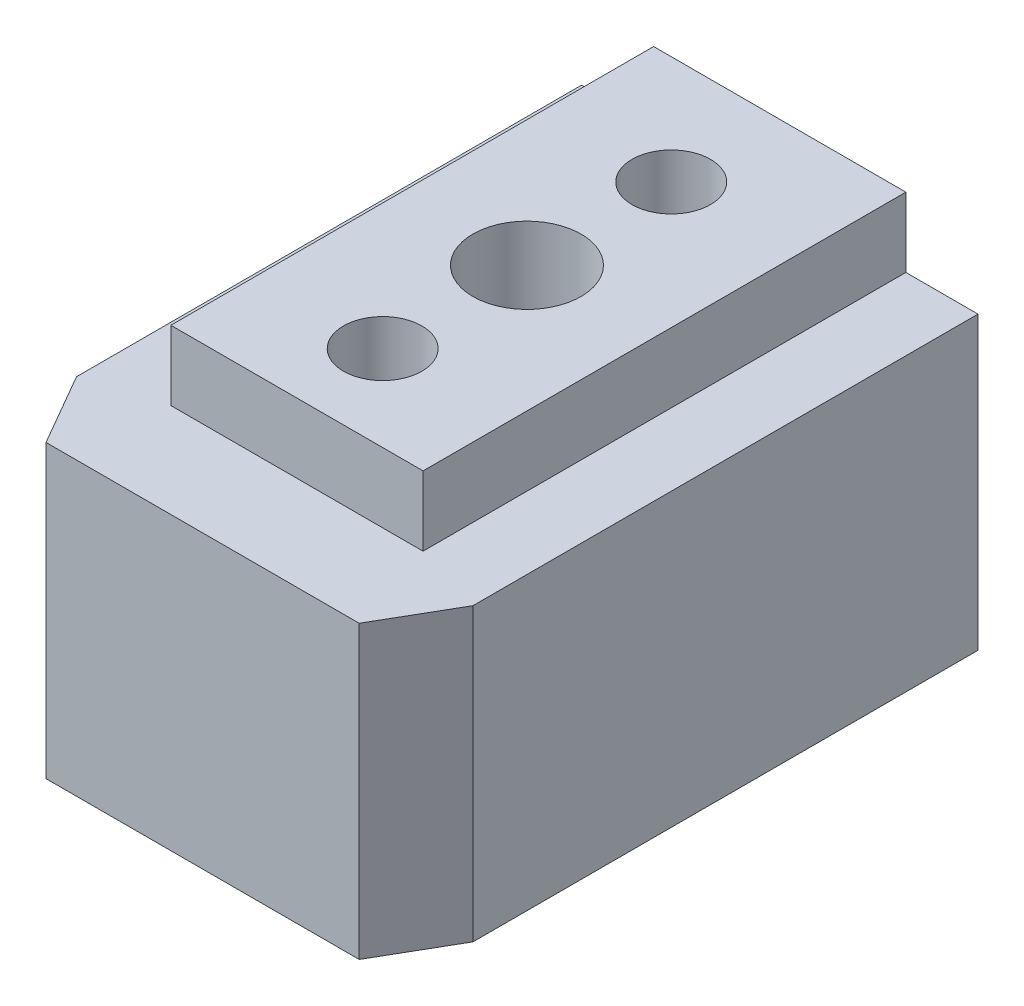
ISO-10303-21;
HEADER;
FILE_DESCRIPTION(('STEP AP214'),'2;1');
FILE_NAME('part.step','',(''),(''),'','','');
FILE_SCHEMA(('AUTOMOTIVE_DESIGN { 1 0 10303 214 1 1 1 1 }'));
ENDSEC;
DATA;
#1=APPLICATION_CONTEXT('core data for automotive mechanical design processes');
#2=APPLICATION_PROTOCOL_DEFINITION('international standard','automotive_design',2000,#1);
#3=PRODUCT_CONTEXT('',#1,'mechanical');
#4=PRODUCT('Part','Part','',(#3));
#5=PRODUCT_RELATED_PRODUCT_CATEGORY('part','',(#4));
#6=PRODUCT_DEFINITION_FORMATION('','',#4);
#7=PRODUCT_DEFINITION_CONTEXT('part definition',#1,'design');
#8=PRODUCT_DEFINITION('design','',#6,#7);
#9=PRODUCT_DEFINITION_SHAPE('','',#8);
#10=(LENGTH_UNIT() NAMED_UNIT(*) SI_UNIT(.MILLI.,.METRE.));
#11=(NAMED_UNIT(*) PLANE_ANGLE_UNIT() SI_UNIT($,.RADIAN.));
#12=(NAMED_UNIT(*) SI_UNIT($,.STERADIAN.) SOLID_ANGLE_UNIT());
#13=UNCERTAINTY_MEASURE_WITH_UNIT(LENGTH_MEASURE(1.E-05),#10,'distance_accuracy_value','');
#14=(GEOMETRIC_REPRESENTATION_CONTEXT(3) GLOBAL_UNCERTAINTY_ASSIGNED_CONTEXT((#13)) GLOBAL_UNIT_ASSIGNED_CONTEXT((#10,
#11,#12)) REPRESENTATION_CONTEXT('',''));
#15=CARTESIAN_POINT('',(0.,0.,0.));
#16=DIRECTION('',(0.,0.,1.));
#17=DIRECTION('',(1.,0.,0.));
#18=AXIS2_PLACEMENT_3D('',#15,#16,#17);
#19=CARTESIAN_POINT('',(-8.7249,6.40715,-12.7));
#20=DIRECTION('',(1.,0.,0.));
#21=DIRECTION('',(0.,0.,-1.));
#22=AXIS2_PLACEMENT_3D('',#19,#20,#21);
#23=PLANE('',#22);
#24=DIRECTION('',(0.,0.,1.));
#25=VECTOR('',#24,1.);
#26=CARTESIAN_POINT('',(-8.7249,-6.40715,-12.7));
#27=LINE('',#26,#25);
#28=CARTESIAN_POINT('',(-8.7249,-6.40715,-12.7));
#29=VERTEX_POINT('',#28);
#30=CARTESIAN_POINT('',(-8.7249,-6.40715,9.52499999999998));
#31=VERTEX_POINT('',#30);
#32=EDGE_CURVE('E216',#29,#31,#27,.T.);
#33=ORIENTED_EDGE('',*,*,#32,.T.);
#34=DIRECTION('',(0.,1.,0.));
#35=VECTOR('',#34,1.);
#36=CARTESIAN_POINT('',(-8.7249,6.40715,9.52499999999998));
#37=LINE('',#36,#35);
#38=CARTESIAN_POINT('',(-8.7249,6.40715,9.52499999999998));
#39=VERTEX_POINT('',#38);
#40=EDGE_CURVE('E44',#31,#39,#37,.T.);
#41=ORIENTED_EDGE('',*,*,#40,.T.);
#42=DIRECTION('',(0.,0.,1.));
#43=VECTOR('',#42,1.);
#44=CARTESIAN_POINT('',(-8.7249,6.40715,-12.7));
#45=LINE('',#44,#43);
#46=CARTESIAN_POINT('',(-8.7249,6.40715,-12.7));
#47=VERTEX_POINT('',#46);
#48=EDGE_CURVE('E225',#47,#39,#45,.T.);
#49=ORIENTED_EDGE('',*,*,#48,.F.);
#50=DIRECTION('',(0.,-1.,0.));
#51=VECTOR('',#50,1.);
#52=CARTESIAN_POINT('',(-8.7249,6.40715,-12.7));
#53=LINE('',#52,#51);
#54=EDGE_CURVE('E226',#47,#29,#53,.T.);
#55=ORIENTED_EDGE('',*,*,#54,.T.);
#56=EDGE_LOOP('',(#33,#41,#49,#55));
#57=FACE_BOUND('',#56,.T.);
#58=ADVANCED_FACE('F36',(#57),#23,.F.);
#59=CARTESIAN_POINT('',(-8.7249,6.40715,12.7));
#60=DIRECTION('',(0.,0.,-1.));
#61=DIRECTION('',(-1.,0.,0.));
#62=AXIS2_PLACEMENT_3D('',#59,#60,#61);
#63=PLANE('',#62);
#64=DIRECTION('',(1.,0.,0.));
#65=VECTOR('',#64,1.);
#66=CARTESIAN_POINT('',(-8.7249,6.40715,12.7));
#67=LINE('',#66,#65);
#68=CARTESIAN_POINT('',(-6.89181289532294,6.40715,12.7));
#69=VERTEX_POINT('',#68);
#70=CARTESIAN_POINT('',(6.89181289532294,6.40715,12.7));
#71=VERTEX_POINT('',#70);
#72=EDGE_CURVE('E209',#69,#71,#67,.T.);
#73=ORIENTED_EDGE('',*,*,#72,.F.);
#74=DIRECTION('',(0.,-1.,0.));
#75=VECTOR('',#74,1.);
#76=CARTESIAN_POINT('',(-6.89181289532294,6.40715,12.7));
#77=LINE('',#76,#75);
#78=CARTESIAN_POINT('',(-6.89181289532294,-6.40715,12.7));
#79=VERTEX_POINT('',#78);
#80=EDGE_CURVE('E201',#69,#79,#77,.T.);
#81=ORIENTED_EDGE('',*,*,#80,.T.);
#82=DIRECTION('',(1.,0.,0.));
#83=VECTOR('',#82,1.);
#84=CARTESIAN_POINT('',(-8.7249,-6.40715,12.7));
#85=LINE('',#84,#83);
#86=CARTESIAN_POINT('',(6.89181289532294,-6.40715,12.7));
#87=VERTEX_POINT('',#86);
#88=EDGE_CURVE('E208',#79,#87,#85,.T.);
#89=ORIENTED_EDGE('',*,*,#88,.T.);
#90=DIRECTION('',(0.,1.,0.));
#91=VECTOR('',#90,1.);
#92=CARTESIAN_POINT('',(6.89181289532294,6.40715,12.7));
#93=LINE('',#92,#91);
#94=EDGE_CURVE('E196',#87,#71,#93,.T.);
#95=ORIENTED_EDGE('',*,*,#94,.T.);
#96=EDGE_LOOP('',(#73,#81,#89,#95));
#97=FACE_BOUND('',#96,.T.);
#98=ADVANCED_FACE('F207',(#97),#63,.F.);
#99=CARTESIAN_POINT('',(8.7249,6.40715,-12.7));
#100=DIRECTION('',(-1.,0.,0.));
#101=DIRECTION('',(0.,0.,1.));
#102=AXIS2_PLACEMENT_3D('',#99,#100,#101);
#103=PLANE('',#102);
#104=DIRECTION('',(0.,0.,-1.));
#105=VECTOR('',#104,1.);
#106=CARTESIAN_POINT('',(8.7249,6.40715,-12.7));
#107=LINE('',#106,#105);
#108=CARTESIAN_POINT('',(8.7249,6.40715,9.52499999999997));
#109=VERTEX_POINT('',#108);
#110=CARTESIAN_POINT('',(8.7249,6.40715,-12.7));
#111=VERTEX_POINT('',#110);
#112=EDGE_CURVE('E237',#109,#111,#107,.T.);
#113=ORIENTED_EDGE('',*,*,#112,.F.);
#114=DIRECTION('',(0.,-1.,0.));
#115=VECTOR('',#114,1.);
#116=CARTESIAN_POINT('',(8.7249,6.40715,9.52499999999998));
#117=LINE('',#116,#115);
#118=CARTESIAN_POINT('',(8.7249,-6.40715,9.52499999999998));
#119=VERTEX_POINT('',#118);
#120=EDGE_CURVE('E189',#109,#119,#117,.T.);
#121=ORIENTED_EDGE('',*,*,#120,.T.);
#122=DIRECTION('',(0.,0.,-1.));
#123=VECTOR('',#122,1.);
#124=CARTESIAN_POINT('',(8.7249,-6.40715,-12.7));
#125=LINE('',#124,#123);
#126=CARTESIAN_POINT('',(8.7249,-6.40715,-12.7));
#127=VERTEX_POINT('',#126);
#128=EDGE_CURVE('E215',#119,#127,#125,.T.);
#129=ORIENTED_EDGE('',*,*,#128,.T.);
#130=DIRECTION('',(0.,-1.,0.));
#131=VECTOR('',#130,1.);
#132=CARTESIAN_POINT('',(8.7249,6.40715,-12.7));
#133=LINE('',#132,#131);
#134=EDGE_CURVE('E193',#111,#127,#133,.T.);
#135=ORIENTED_EDGE('',*,*,#134,.F.);
#136=EDGE_LOOP('',(#113,#121,#129,#135));
#137=FACE_BOUND('',#136,.T.);
#138=ADVANCED_FACE('F288',(#137),#103,.F.);
#139=CARTESIAN_POINT('',(-8.7249,6.40715,-12.7));
#140=DIRECTION('',(0.,0.,1.));
#141=DIRECTION('',(1.,0.,0.));
#142=AXIS2_PLACEMENT_3D('',#139,#140,#141);
#143=PLANE('',#142);
#144=CARTESIAN_POINT('',(-5.55498,-3.23215,-12.7));
#145=DIRECTION('',(0.,0.,-1.));
#146=DIRECTION('',(-1.,0.,0.));
#147=AXIS2_PLACEMENT_3D('',#144,#145,#146);
#148=CIRCLE('',#147,1.5875);
#149=CARTESIAN_POINT('',(-7.14248,-3.23215,-12.7));
#150=VERTEX_POINT('',#149);
#151=EDGE_CURVE('E526',#150,#150,#148,.T.);
#152=ORIENTED_EDGE('',*,*,#151,.F.);
#153=EDGE_LOOP('',(#152));
#154=FACE_BOUND('',#153,.T.);
#155=CARTESIAN_POINT('',(5.55498,-3.23215,-12.7));
#156=DIRECTION('',(0.,0.,-1.));
#157=DIRECTION('',(-1.,0.,0.));
#158=AXIS2_PLACEMENT_3D('',#155,#156,#157);
#159=CIRCLE('',#158,1.5875);
#160=CARTESIAN_POINT('',(3.96748,-3.23215,-12.7));
#161=VERTEX_POINT('',#160);
#162=EDGE_CURVE('E140',#161,#161,#159,.T.);
#163=ORIENTED_EDGE('',*,*,#162,.F.);
#164=EDGE_LOOP('',(#163));
#165=FACE_BOUND('',#164,.T.);
#166=CARTESIAN_POINT('',(5.55498,3.11785,-12.7));
#167=DIRECTION('',(0.,0.,-1.));
#168=DIRECTION('',(-1.,0.,0.));
#169=AXIS2_PLACEMENT_3D('',#166,#167,#168);
#170=CIRCLE('',#169,1.72719999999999);
#171=CARTESIAN_POINT('',(3.82778000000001,3.11785,-12.7));
#172=VERTEX_POINT('',#171);
#173=EDGE_CURVE('E133',#172,#172,#170,.T.);
#174=ORIENTED_EDGE('',*,*,#173,.F.);
#175=EDGE_LOOP('',(#174));
#176=FACE_BOUND('',#175,.T.);
#177=CARTESIAN_POINT('',(-5.55498,3.11785,-12.7));
#178=DIRECTION('',(0.,0.,-1.));
#179=DIRECTION('',(-1.,0.,0.));
#180=AXIS2_PLACEMENT_3D('',#177,#178,#179);
#181=CIRCLE('',#180,1.72719999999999);
#182=CARTESIAN_POINT('',(-7.28217999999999,3.11785,-12.7));
#183=VERTEX_POINT('',#182);
#184=EDGE_CURVE('E146',#183,#183,#181,.T.);
#185=ORIENTED_EDGE('',*,*,#184,.F.);
#186=EDGE_LOOP('',(#185));
#187=FACE_BOUND('',#186,.T.);
#188=DIRECTION('',(-1.,0.,0.));
#189=VECTOR('',#188,1.);
#190=CARTESIAN_POINT('',(-8.7249,-6.40715,-12.7));
#191=LINE('',#190,#189);
#192=EDGE_CURVE('E218',#127,#29,#191,.T.);
#193=ORIENTED_EDGE('',*,*,#192,.T.);
#194=ORIENTED_EDGE('',*,*,#54,.F.);
#195=DIRECTION('',(-1.,0.,0.));
#196=VECTOR('',#195,1.);
#197=CARTESIAN_POINT('',(-8.7249,6.40715,-12.7));
#198=LINE('',#197,#196);
#199=CARTESIAN_POINT('',(-5.5499,6.40715,-12.7));
#200=VERTEX_POINT('',#199);
#201=EDGE_CURVE('E233',#200,#47,#198,.T.);
#202=ORIENTED_EDGE('',*,*,#201,.F.);
#203=DIRECTION('',(0.,-1.,0.));
#204=VECTOR('',#203,1.);
#205=CARTESIAN_POINT('',(-5.5499,9.46785,-12.7));
#206=LINE('',#205,#204);
#207=CARTESIAN_POINT('',(-5.5499,9.46785,-12.7));
#208=VERTEX_POINT('',#207);
#209=EDGE_CURVE('E244',#208,#200,#206,.T.);
#210=ORIENTED_EDGE('',*,*,#209,.F.);
#211=DIRECTION('',(-1.,0.,0.));
#212=VECTOR('',#211,1.);
#213=CARTESIAN_POINT('',(5.5499,9.46785,-12.7));
#214=LINE('',#213,#212);
#215=CARTESIAN_POINT('',(5.5499,9.46785,-12.7));
#216=VERTEX_POINT('',#215);
#217=EDGE_CURVE('E171',#216,#208,#214,.T.);
#218=ORIENTED_EDGE('',*,*,#217,.F.);
#219=DIRECTION('',(0.,-1.,0.));
#220=VECTOR('',#219,1.);
#221=CARTESIAN_POINT('',(5.5499,9.46785,-12.7));
#222=LINE('',#221,#220);
#223=CARTESIAN_POINT('',(5.5499,6.40715,-12.7));
#224=VERTEX_POINT('',#223);
#225=EDGE_CURVE('E220',#216,#224,#222,.T.);
#226=ORIENTED_EDGE('',*,*,#225,.T.);
#227=EDGE_CURVE('E229',#111,#224,#198,.T.);
#228=ORIENTED_EDGE('',*,*,#227,.F.);
#229=ORIENTED_EDGE('',*,*,#134,.T.);
#230=EDGE_LOOP('',(#193,#194,#202,#210,#218,#226,#228,#229));
#231=FACE_BOUND('',#230,.T.);
#232=ADVANCED_FACE('F268',(#154,#165,#176,#187,#231),#143,.F.);
#233=CARTESIAN_POINT('',(-8.7249,6.40715,12.7));
#234=DIRECTION('',(0.,1.,0.));
#235=DIRECTION('',(0.,0.,1.));
#236=AXIS2_PLACEMENT_3D('',#233,#234,#235);
#237=PLANE('',#236);
#238=ORIENTED_EDGE('',*,*,#48,.T.);
#239=DIRECTION('',(-0.499999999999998,0.,-0.86602540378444));
#240=VECTOR('',#239,1.);
#241=CARTESIAN_POINT('',(-7.3500846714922,6.40715,11.90625));
#242=LINE('',#241,#240);
#243=EDGE_CURVE('E11',#39,#69,#242,.F.);
#244=ORIENTED_EDGE('',*,*,#243,.T.);
#245=ORIENTED_EDGE('',*,*,#72,.T.);
#246=DIRECTION('',(-0.499999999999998,0.,0.86602540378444));
#247=VECTOR('',#246,1.);
#248=CARTESIAN_POINT('',(2.98763467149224,6.40715,19.4622350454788));
#249=LINE('',#248,#247);
#250=EDGE_CURVE('E199',#71,#109,#249,.F.);
#251=ORIENTED_EDGE('',*,*,#250,.T.);
#252=ORIENTED_EDGE('',*,*,#112,.T.);
#253=ORIENTED_EDGE('',*,*,#227,.T.);
#254=DIRECTION('',(0.,0.,-1.));
#255=VECTOR('',#254,1.);
#256=CARTESIAN_POINT('',(5.5499,6.40715,-12.7));
#257=LINE('',#256,#255);
#258=CARTESIAN_POINT('',(5.5499,6.40715,8.5471));
#259=VERTEX_POINT('',#258);
#260=EDGE_CURVE('E167',#259,#224,#257,.T.);
#261=ORIENTED_EDGE('',*,*,#260,.F.);
#262=DIRECTION('',(1.,0.,0.));
#263=VECTOR('',#262,1.);
#264=CARTESIAN_POINT('',(5.5499,6.40715,8.5471));
#265=LINE('',#264,#263);
#266=CARTESIAN_POINT('',(-5.5499,6.40715,8.5471));
#267=VERTEX_POINT('',#266);
#268=EDGE_CURVE('E172',#267,#259,#265,.T.);
#269=ORIENTED_EDGE('',*,*,#268,.F.);
#270=DIRECTION('',(0.,0.,1.));
#271=VECTOR('',#270,1.);
#272=CARTESIAN_POINT('',(-5.5499,6.40715,-12.7));
#273=LINE('',#272,#271);
#274=EDGE_CURVE('E186',#200,#267,#273,.T.);
#275=ORIENTED_EDGE('',*,*,#274,.F.);
#276=ORIENTED_EDGE('',*,*,#201,.T.);
#277=EDGE_LOOP('',(#238,#244,#245,#251,#252,#253,#261,#269,#275,#276));
#278=FACE_BOUND('',#277,.T.);
#279=ADVANCED_FACE('F304',(#278),#237,.T.);
#280=CARTESIAN_POINT('',(-8.7249,-6.40715,12.7));
#281=DIRECTION('',(0.,1.,0.));
#282=DIRECTION('',(0.,0.,1.));
#283=AXIS2_PLACEMENT_3D('',#280,#281,#282);
#284=PLANE('',#283);
#285=ORIENTED_EDGE('',*,*,#88,.F.);
#286=DIRECTION('',(0.499999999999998,0.,0.86602540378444));
#287=VECTOR('',#286,1.);
#288=CARTESIAN_POINT('',(-6.89181289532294,-6.40715,12.7));
#289=LINE('',#288,#287);
#290=EDGE_CURVE('E58',#79,#31,#289,.F.);
#291=ORIENTED_EDGE('',*,*,#290,.T.);
#292=ORIENTED_EDGE('',*,*,#32,.F.);
#293=ORIENTED_EDGE('',*,*,#192,.F.);
#294=ORIENTED_EDGE('',*,*,#128,.F.);
#295=DIRECTION('',(0.499999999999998,0.,-0.86602540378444));
#296=VECTOR('',#295,1.);
#297=CARTESIAN_POINT('',(8.7249,-6.40715,9.52499999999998));
#298=LINE('',#297,#296);
#299=EDGE_CURVE('E192',#119,#87,#298,.F.);
#300=ORIENTED_EDGE('',*,*,#299,.T.);
#301=EDGE_LOOP('',(#285,#291,#292,#293,#294,#300));
#302=FACE_BOUND('',#301,.T.);
#303=ADVANCED_FACE('F212',(#302),#284,.F.);
#304=CARTESIAN_POINT('',(5.5499,9.46785,-12.7));
#305=DIRECTION('',(-1.,0.,0.));
#306=DIRECTION('',(0.,0.,1.));
#307=AXIS2_PLACEMENT_3D('',#304,#305,#306);
#308=PLANE('',#307);
#309=ORIENTED_EDGE('',*,*,#260,.T.);
#310=ORIENTED_EDGE('',*,*,#225,.F.);
#311=DIRECTION('',(0.,0.,-1.));
#312=VECTOR('',#311,1.);
#313=CARTESIAN_POINT('',(5.5499,9.46785,-12.7));
#314=LINE('',#313,#312);
#315=CARTESIAN_POINT('',(5.5499,9.46785,8.5471));
#316=VERTEX_POINT('',#315);
#317=EDGE_CURVE('E168',#316,#216,#314,.T.);
#318=ORIENTED_EDGE('',*,*,#317,.F.);
#319=DIRECTION('',(0.,-1.,0.));
#320=VECTOR('',#319,1.);
#321=CARTESIAN_POINT('',(5.5499,9.46785,8.5471));
#322=LINE('',#321,#320);
#323=EDGE_CURVE('E178',#316,#259,#322,.T.);
#324=ORIENTED_EDGE('',*,*,#323,.T.);
#325=EDGE_LOOP('',(#309,#310,#318,#324));
#326=FACE_BOUND('',#325,.T.);
#327=ADVANCED_FACE('F249',(#326),#308,.F.);
#328=CARTESIAN_POINT('',(-5.5499,9.46785,-12.7));
#329=DIRECTION('',(1.,0.,0.));
#330=DIRECTION('',(0.,0.,-1.));
#331=AXIS2_PLACEMENT_3D('',#328,#329,#330);
#332=PLANE('',#331);
#333=ORIENTED_EDGE('',*,*,#274,.T.);
#334=DIRECTION('',(0.,-1.,0.));
#335=VECTOR('',#334,1.);
#336=CARTESIAN_POINT('',(-5.5499,9.46785,8.5471));
#337=LINE('',#336,#335);
#338=CARTESIAN_POINT('',(-5.5499,9.46785,8.5471));
#339=VERTEX_POINT('',#338);
#340=EDGE_CURVE('E242',#339,#267,#337,.T.);
#341=ORIENTED_EDGE('',*,*,#340,.F.);
#342=DIRECTION('',(0.,0.,1.));
#343=VECTOR('',#342,1.);
#344=CARTESIAN_POINT('',(-5.5499,9.46785,-12.7));
#345=LINE('',#344,#343);
#346=EDGE_CURVE('E174',#208,#339,#345,.T.);
#347=ORIENTED_EDGE('',*,*,#346,.F.);
#348=ORIENTED_EDGE('',*,*,#209,.T.);
#349=EDGE_LOOP('',(#333,#341,#347,#348));
#350=FACE_BOUND('',#349,.T.);
#351=ADVANCED_FACE('F274',(#350),#332,.F.);
#352=CARTESIAN_POINT('',(5.5499,9.46785,8.5471));
#353=DIRECTION('',(0.,0.,-1.));
#354=DIRECTION('',(-1.,0.,0.));
#355=AXIS2_PLACEMENT_3D('',#352,#353,#354);
#356=PLANE('',#355);
#357=ORIENTED_EDGE('',*,*,#268,.T.);
#358=ORIENTED_EDGE('',*,*,#323,.F.);
#359=DIRECTION('',(1.,0.,0.));
#360=VECTOR('',#359,1.);
#361=CARTESIAN_POINT('',(5.5499,9.46785,8.5471));
#362=LINE('',#361,#360);
#363=EDGE_CURVE('E176',#339,#316,#362,.T.);
#364=ORIENTED_EDGE('',*,*,#363,.F.);
#365=ORIENTED_EDGE('',*,*,#340,.T.);
#366=EDGE_LOOP('',(#357,#358,#364,#365));
#367=FACE_BOUND('',#366,.T.);
#368=ADVANCED_FACE('F254',(#367),#356,.F.);
#369=CARTESIAN_POINT('',(5.5499,9.46785,8.5471));
#370=DIRECTION('',(0.,-1.,0.));
#371=DIRECTION('',(0.,0.,-1.));
#372=AXIS2_PLACEMENT_3D('',#369,#370,#371);
#373=PLANE('',#372);
#374=CARTESIAN_POINT('',(0.,9.46785,-1.5748));
#375=DIRECTION('',(0.,1.,0.));
#376=DIRECTION('',(0.,0.,1.));
#377=AXIS2_PLACEMENT_3D('',#374,#375,#376);
#378=CIRCLE('',#377,2.38125);
#379=CARTESIAN_POINT('',(0.,9.46785,0.806450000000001));
#380=VERTEX_POINT('',#379);
#381=EDGE_CURVE('E149',#380,#380,#378,.T.);
#382=ORIENTED_EDGE('',*,*,#381,.F.);
#383=EDGE_LOOP('',(#382));
#384=FACE_BOUND('',#383,.T.);
#385=CARTESIAN_POINT('',(0.,9.46785,4.7752));
#386=DIRECTION('',(0.,1.,0.));
#387=DIRECTION('',(0.,0.,1.));
#388=AXIS2_PLACEMENT_3D('',#385,#386,#387);
#389=CIRCLE('',#388,1.7272);
#390=CARTESIAN_POINT('',(0.,9.46785,6.5024));
#391=VERTEX_POINT('',#390);
#392=EDGE_CURVE('E158',#391,#391,#389,.T.);
#393=ORIENTED_EDGE('',*,*,#392,.F.);
#394=EDGE_LOOP('',(#393));
#395=FACE_BOUND('',#394,.T.);
#396=CARTESIAN_POINT('',(0.,9.46785,-7.9248));
#397=DIRECTION('',(0.,1.,0.));
#398=DIRECTION('',(0.,0.,1.));
#399=AXIS2_PLACEMENT_3D('',#396,#397,#398);
#400=CIRCLE('',#399,1.7272);
#401=CARTESIAN_POINT('',(0.,9.46785,-6.1976));
#402=VERTEX_POINT('',#401);
#403=EDGE_CURVE('E164',#402,#402,#400,.T.);
#404=ORIENTED_EDGE('',*,*,#403,.F.);
#405=EDGE_LOOP('',(#404));
#406=FACE_BOUND('',#405,.T.);
#407=ORIENTED_EDGE('',*,*,#317,.T.);
#408=ORIENTED_EDGE('',*,*,#217,.T.);
#409=ORIENTED_EDGE('',*,*,#346,.T.);
#410=ORIENTED_EDGE('',*,*,#363,.T.);
#411=EDGE_LOOP('',(#407,#408,#409,#410));
#412=FACE_BOUND('',#411,.T.);
#413=ADVANCED_FACE('F273',(#384,#395,#406,#412),#373,.F.);
#414=CARTESIAN_POINT('',(8.7249,6.40715,9.52499999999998));
#415=DIRECTION('',(-0.86602540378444,0.,-0.499999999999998));
#416=DIRECTION('',(-0.499999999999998,0.,0.86602540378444));
#417=AXIS2_PLACEMENT_3D('',#414,#415,#416);
#418=PLANE('',#417);
#419=ORIENTED_EDGE('',*,*,#250,.F.);
#420=ORIENTED_EDGE('',*,*,#94,.F.);
#421=ORIENTED_EDGE('',*,*,#299,.F.);
#422=ORIENTED_EDGE('',*,*,#120,.F.);
#423=EDGE_LOOP('',(#419,#420,#421,#422));
#424=FACE_BOUND('',#423,.T.);
#425=ADVANCED_FACE('F291',(#424),#418,.F.);
#426=CARTESIAN_POINT('',(-6.89181289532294,6.40715,12.7));
#427=DIRECTION('',(0.86602540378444,0.,-0.499999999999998));
#428=DIRECTION('',(-0.499999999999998,0.,-0.86602540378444));
#429=AXIS2_PLACEMENT_3D('',#426,#427,#428);
#430=PLANE('',#429);
#431=ORIENTED_EDGE('',*,*,#243,.F.);
#432=ORIENTED_EDGE('',*,*,#40,.F.);
#433=ORIENTED_EDGE('',*,*,#290,.F.);
#434=ORIENTED_EDGE('',*,*,#80,.F.);
#435=EDGE_LOOP('',(#431,#432,#433,#434));
#436=FACE_BOUND('',#435,.T.);
#437=ADVANCED_FACE('F38',(#436),#430,.F.);
#438=CARTESIAN_POINT('',(0.,9.46785,-7.9248));
#439=DIRECTION('',(0.,1.,0.));
#440=DIRECTION('',(0.,0.,1.));
#441=AXIS2_PLACEMENT_3D('',#438,#439,#440);
#442=CYLINDRICAL_SURFACE('',#441,1.7272);
#443=CARTESIAN_POINT('',(0.,-2.82575,-7.9248));
#444=DIRECTION('',(0.,1.,0.));
#445=DIRECTION('',(0.,0.,1.));
#446=AXIS2_PLACEMENT_3D('',#443,#444,#445);
#447=CIRCLE('',#446,1.7272);
#448=CARTESIAN_POINT('',(0.,-2.82575,-6.1976));
#449=VERTEX_POINT('',#448);
#450=EDGE_CURVE('E161',#449,#449,#447,.T.);
#451=ORIENTED_EDGE('',*,*,#450,.F.);
#452=EDGE_LOOP('',(#451));
#453=FACE_BOUND('',#452,.T.);
#454=ORIENTED_EDGE('',*,*,#403,.T.);
#455=EDGE_LOOP('',(#454));
#456=FACE_BOUND('',#455,.T.);
#457=ADVANCED_FACE('F298',(#453,#456),#442,.F.);
#458=CARTESIAN_POINT('',(0.,-2.82575,-7.9248));
#459=DIRECTION('',(0.,1.,0.));
#460=DIRECTION('',(0.,0.,1.));
#461=AXIS2_PLACEMENT_3D('',#458,#459,#460);
#462=CONICAL_SURFACE('',#461,1.7272,1.02974425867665);
#463=CARTESIAN_POINT('',(0.,-3.8635564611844,-7.9248));
#464=VERTEX_POINT('',#463);
#465=VERTEX_LOOP('',#464);
#466=FACE_BOUND('',#465,.T.);
#467=ORIENTED_EDGE('',*,*,#450,.T.);
#468=EDGE_LOOP('',(#467));
#469=FACE_BOUND('',#468,.T.);
#470=ADVANCED_FACE('F380',(#466,#469),#462,.F.);
#471=CARTESIAN_POINT('',(0.,9.46785,4.7752));
#472=DIRECTION('',(0.,1.,0.));
#473=DIRECTION('',(0.,0.,1.));
#474=AXIS2_PLACEMENT_3D('',#471,#472,#473);
#475=CYLINDRICAL_SURFACE('',#474,1.7272);
#476=CARTESIAN_POINT('',(0.,-2.82575,4.7752));
#477=DIRECTION('',(0.,1.,0.));
#478=DIRECTION('',(0.,0.,1.));
#479=AXIS2_PLACEMENT_3D('',#476,#477,#478);
#480=CIRCLE('',#479,1.7272);
#481=CARTESIAN_POINT('',(0.,-2.82575,6.5024));
#482=VERTEX_POINT('',#481);
#483=EDGE_CURVE('E153',#482,#482,#480,.T.);
#484=ORIENTED_EDGE('',*,*,#483,.F.);
#485=EDGE_LOOP('',(#484));
#486=FACE_BOUND('',#485,.T.);
#487=ORIENTED_EDGE('',*,*,#392,.T.);
#488=EDGE_LOOP('',(#487));
#489=FACE_BOUND('',#488,.T.);
#490=ADVANCED_FACE('F390',(#486,#489),#475,.F.);
#491=CARTESIAN_POINT('',(0.,-2.82575,4.7752));
#492=DIRECTION('',(0.,1.,0.));
#493=DIRECTION('',(0.,0.,1.));
#494=AXIS2_PLACEMENT_3D('',#491,#492,#493);
#495=CONICAL_SURFACE('',#494,1.7272,1.02974425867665);
#496=CARTESIAN_POINT('',(0.,-3.8635564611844,4.7752));
#497=VERTEX_POINT('',#496);
#498=VERTEX_LOOP('',#497);
#499=FACE_BOUND('',#498,.T.);
#500=ORIENTED_EDGE('',*,*,#483,.T.);
#501=EDGE_LOOP('',(#500));
#502=FACE_BOUND('',#501,.T.);
#503=ADVANCED_FACE('F399',(#499,#502),#495,.F.);
#504=CARTESIAN_POINT('',(0.,-0.0571500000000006,-1.5748));
#505=DIRECTION('',(0.,1.,0.));
#506=DIRECTION('',(0.,0.,1.));
#507=AXIS2_PLACEMENT_3D('',#504,#505,#506);
#508=CYLINDRICAL_SURFACE('',#507,2.38125);
#509=CARTESIAN_POINT('',(0.,-0.0571500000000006,-1.5748));
#510=DIRECTION('',(0.,1.,0.));
#511=DIRECTION('',(0.,0.,1.));
#512=AXIS2_PLACEMENT_3D('',#509,#510,#511);
#513=CIRCLE('',#512,2.38125);
#514=CARTESIAN_POINT('',(0.,-0.0571500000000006,0.806450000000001));
#515=VERTEX_POINT('',#514);
#516=EDGE_CURVE('E150',#515,#515,#513,.T.);
#517=CARTESIAN_POINT('',(0.,-0.0571500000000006,0.806450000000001));
#518=CARTESIAN_POINT('',(0.,0.0420687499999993,0.806450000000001));
#519=CARTESIAN_POINT('',(0.,0.141287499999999,0.806450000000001));
#520=CARTESIAN_POINT('',(0.,0.339724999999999,0.806450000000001));
#521=CARTESIAN_POINT('',(0.,0.438943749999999,0.806450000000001));
#522=CARTESIAN_POINT('',(0.,0.637381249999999,0.806450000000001));
#523=CARTESIAN_POINT('',(0.,0.736599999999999,0.806450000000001));
#524=CARTESIAN_POINT('',(0.,0.9350375,0.806450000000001));
#525=CARTESIAN_POINT('',(0.,1.03425625,0.806450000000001));
#526=CARTESIAN_POINT('',(0.,1.23269375,0.806450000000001));
#527=CARTESIAN_POINT('',(0.,1.3319125,0.806450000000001));
#528=CARTESIAN_POINT('',(0.,1.53035,0.806450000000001));
#529=CARTESIAN_POINT('',(0.,1.62956875,0.806450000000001));
#530=CARTESIAN_POINT('',(0.,1.82800625,0.806450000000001));
#531=CARTESIAN_POINT('',(0.,1.927225,0.806450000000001));
#532=CARTESIAN_POINT('',(0.,2.1256625,0.806450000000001));
#533=CARTESIAN_POINT('',(0.,2.22488125,0.806450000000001));
#534=CARTESIAN_POINT('',(0.,2.42331875,0.806450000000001));
#535=CARTESIAN_POINT('',(0.,2.5225375,0.806450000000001));
#536=CARTESIAN_POINT('',(0.,2.720975,0.806450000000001));
#537=CARTESIAN_POINT('',(0.,2.82019375,0.806450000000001));
#538=CARTESIAN_POINT('',(0.,3.01863125,0.806450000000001));
#539=CARTESIAN_POINT('',(0.,3.11785,0.806450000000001));
#540=CARTESIAN_POINT('',(0.,3.3162875,0.806450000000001));
#541=CARTESIAN_POINT('',(0.,3.41550625,0.806450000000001));
#542=CARTESIAN_POINT('',(0.,3.61394375,0.806450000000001));
#543=CARTESIAN_POINT('',(0.,3.7131625,0.806450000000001));
#544=CARTESIAN_POINT('',(0.,3.9116,0.806450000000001));
#545=CARTESIAN_POINT('',(0.,4.01081875,0.806450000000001));
#546=CARTESIAN_POINT('',(0.,4.20925625,0.806450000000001));
#547=CARTESIAN_POINT('',(0.,4.308475,0.806450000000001));
#548=CARTESIAN_POINT('',(0.,4.5069125,0.806450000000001));
#549=CARTESIAN_POINT('',(0.,4.60613125,0.806450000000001));
#550=CARTESIAN_POINT('',(0.,4.80456875,0.806450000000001));
#551=CARTESIAN_POINT('',(0.,4.9037875,0.806450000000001));
#552=CARTESIAN_POINT('',(0.,5.102225,0.806450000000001));
#553=CARTESIAN_POINT('',(0.,5.20144375,0.806450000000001));
#554=CARTESIAN_POINT('',(0.,5.39988125,0.806450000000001));
#555=CARTESIAN_POINT('',(0.,5.4991,0.806450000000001));
#556=CARTESIAN_POINT('',(0.,5.6975375,0.806450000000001));
#557=CARTESIAN_POINT('',(0.,5.79675625,0.806450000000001));
#558=CARTESIAN_POINT('',(0.,5.99519375,0.806450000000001));
#559=CARTESIAN_POINT('',(0.,6.0944125,0.806450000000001));
#560=CARTESIAN_POINT('',(0.,6.29285,0.806450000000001));
#561=CARTESIAN_POINT('',(0.,6.39206875,0.806450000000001));
#562=CARTESIAN_POINT('',(0.,6.59050625,0.806450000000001));
#563=CARTESIAN_POINT('',(0.,6.689725,0.806450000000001));
#564=CARTESIAN_POINT('',(0.,6.8881625,0.806450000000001));
#565=CARTESIAN_POINT('',(0.,6.98738125,0.806450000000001));
#566=CARTESIAN_POINT('',(0.,7.18581875,0.806450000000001));
#567=CARTESIAN_POINT('',(0.,7.2850375,0.806450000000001));
#568=CARTESIAN_POINT('',(0.,7.483475,0.806450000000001));
#569=CARTESIAN_POINT('',(0.,7.58269375,0.806450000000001));
#570=CARTESIAN_POINT('',(0.,7.78113125,0.806450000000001));
#571=CARTESIAN_POINT('',(0.,7.88035,0.806450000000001));
#572=CARTESIAN_POINT('',(0.,8.0787875,0.806450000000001));
#573=CARTESIAN_POINT('',(0.,8.17800625,0.806450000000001));
#574=CARTESIAN_POINT('',(0.,8.37644375,0.806450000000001));
#575=CARTESIAN_POINT('',(0.,8.4756625,0.806450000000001));
#576=CARTESIAN_POINT('',(0.,8.6741,0.806450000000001));
#577=CARTESIAN_POINT('',(0.,8.77331875,0.806450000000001));
#578=CARTESIAN_POINT('',(0.,8.97175625,0.806450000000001));
#579=CARTESIAN_POINT('',(0.,9.070975,0.806450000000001));
#580=CARTESIAN_POINT('',(0.,9.2694125,0.806450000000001));
#581=CARTESIAN_POINT('',(0.,9.36863125,0.806450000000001));
#582=CARTESIAN_POINT('',(0.,9.46785,0.806450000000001));
#583=B_SPLINE_CURVE_WITH_KNOTS('',3,(#517,#518,#519,#520,#521,#522,#523,#524,#525,#526,#527,
#528,#529,#530,#531,#532,#533,#534,#535,#536,#537,#538,#539,#540,#541,#542,#543,#544,#545,#546,
#547,#548,#549,#550,#551,#552,#553,#554,#555,#556,#557,#558,#559,#560,#561,#562,#563,#564,#565,
#566,#567,#568,#569,#570,#571,#572,#573,#574,#575,#576,#577,#578,#579,#580,#581,#582),
.UNSPECIFIED.,.F.,.F.,(4,2,2,2,2,2,2,2,2,2,2,2,2,2,2,2,2,2,2,2,2,2,2,2,2,2,2,2,2,2,2,2,4),(0.,
0.29765625,0.5953125,0.89296875,1.190625,1.48828125,1.7859375,2.08359375,2.38125,2.67890625,
2.9765625,3.27421875,3.571875,3.86953125,4.1671875,4.46484375,4.7625,5.06015625,5.3578125,
5.65546875,5.953125,6.25078125,6.5484375,6.84609375,7.14375,7.44140625,7.7390625,8.03671875,
8.334375,8.63203125,8.9296875,9.22734375,9.525),.UNSPECIFIED.);
#584=EDGE_CURVE('BSEAM409',#515,#380,#583,.T.);
#585=ORIENTED_EDGE('',*,*,#516,.F.);
#586=ORIENTED_EDGE('',*,*,#381,.T.);
#587=ORIENTED_EDGE('',*,*,#584,.T.);
#588=ORIENTED_EDGE('',*,*,#584,.F.);
#589=EDGE_LOOP('',(#585,#587,#586,#588));
#590=FACE_BOUND('',#589,.T.);
#591=ADVANCED_FACE('F409',(#590),#508,.F.);
#592=CARTESIAN_POINT('',(0.,-0.0571500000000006,-1.5748));
#593=DIRECTION('',(0.,1.,0.));
#594=DIRECTION('',(0.,0.,1.));
#595=AXIS2_PLACEMENT_3D('',#592,#593,#594);
#596=PLANE('',#595);
#597=ORIENTED_EDGE('',*,*,#516,.T.);
#598=EDGE_LOOP('',(#597));
#599=FACE_BOUND('',#598,.T.);
#600=ADVANCED_FACE('F418',(#599),#596,.T.);
#601=CARTESIAN_POINT('',(-5.55498,3.11785,-12.7));
#602=DIRECTION('',(0.,0.,-1.));
#603=DIRECTION('',(-1.,0.,0.));
#604=AXIS2_PLACEMENT_3D('',#601,#602,#603);
#605=CYLINDRICAL_SURFACE('',#604,1.72719999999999);
#606=CARTESIAN_POINT('',(-5.55498,3.11785,-0.405993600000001));
#607=DIRECTION('',(0.,0.,-1.));
#608=DIRECTION('',(-1.,0.,0.));
#609=AXIS2_PLACEMENT_3D('',#606,#607,#608);
#610=CIRCLE('',#609,1.7272);
#611=CARTESIAN_POINT('',(-7.28218,3.11785,-0.405993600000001));
#612=VERTEX_POINT('',#611);
#613=EDGE_CURVE('E137',#612,#612,#610,.T.);
#614=ORIENTED_EDGE('',*,*,#613,.F.);
#615=EDGE_LOOP('',(#614));
#616=FACE_BOUND('',#615,.T.);
#617=ORIENTED_EDGE('',*,*,#184,.T.);
#618=EDGE_LOOP('',(#617));
#619=FACE_BOUND('',#618,.T.);
#620=ADVANCED_FACE('F427',(#616,#619),#605,.F.);
#621=CARTESIAN_POINT('',(-5.55498,3.11785,-0.405993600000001));
#622=DIRECTION('',(0.,0.,-1.));
#623=DIRECTION('',(-1.,0.,0.));
#624=AXIS2_PLACEMENT_3D('',#621,#622,#623);
#625=CONICAL_SURFACE('',#624,1.7272,1.02974425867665);
#626=CARTESIAN_POINT('',(-5.55498,3.11785,0.631812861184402));
#627=VERTEX_POINT('',#626);
#628=VERTEX_LOOP('',#627);
#629=FACE_BOUND('',#628,.T.);
#630=ORIENTED_EDGE('',*,*,#613,.T.);
#631=EDGE_LOOP('',(#630));
#632=FACE_BOUND('',#631,.T.);
#633=ADVANCED_FACE('F436',(#629,#632),#625,.F.);
#634=CARTESIAN_POINT('',(5.55498,3.11785,-12.7));
#635=DIRECTION('',(0.,0.,-1.));
#636=DIRECTION('',(-1.,0.,0.));
#637=AXIS2_PLACEMENT_3D('',#634,#635,#636);
#638=CYLINDRICAL_SURFACE('',#637,1.72719999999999);
#639=CARTESIAN_POINT('',(5.55498,3.11785,-0.405993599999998));
#640=DIRECTION('',(0.,0.,-1.));
#641=DIRECTION('',(-1.,0.,0.));
#642=AXIS2_PLACEMENT_3D('',#639,#640,#641);
#643=CIRCLE('',#642,1.7272);
#644=CARTESIAN_POINT('',(3.82778,3.11785,-0.405993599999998));
#645=VERTEX_POINT('',#644);
#646=EDGE_CURVE('E131',#645,#645,#643,.T.);
#647=ORIENTED_EDGE('',*,*,#646,.F.);
#648=EDGE_LOOP('',(#647));
#649=FACE_BOUND('',#648,.T.);
#650=ORIENTED_EDGE('',*,*,#173,.T.);
#651=EDGE_LOOP('',(#650));
#652=FACE_BOUND('',#651,.T.);
#653=ADVANCED_FACE('F127',(#649,#652),#638,.F.);
#654=CARTESIAN_POINT('',(5.55498,3.11785,-0.405993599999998));
#655=DIRECTION('',(0.,0.,-1.));
#656=DIRECTION('',(-1.,0.,0.));
#657=AXIS2_PLACEMENT_3D('',#654,#655,#656);
#658=CONICAL_SURFACE('',#657,1.7272,1.02974425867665);
#659=CARTESIAN_POINT('',(5.55498,3.11785,0.631812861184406));
#660=VERTEX_POINT('',#659);
#661=VERTEX_LOOP('',#660);
#662=FACE_BOUND('',#661,.T.);
#663=ORIENTED_EDGE('',*,*,#646,.T.);
#664=EDGE_LOOP('',(#663));
#665=FACE_BOUND('',#664,.T.);
#666=ADVANCED_FACE('F123',(#662,#665),#658,.F.);
#667=CARTESIAN_POINT('',(5.55498,-3.23215,-3.175));
#668=DIRECTION('',(0.,0.,-1.));
#669=DIRECTION('',(-1.,0.,0.));
#670=AXIS2_PLACEMENT_3D('',#667,#668,#669);
#671=CYLINDRICAL_SURFACE('',#670,1.5875);
#672=CARTESIAN_POINT('',(5.55498,-3.23215,-3.175));
#673=DIRECTION('',(0.,0.,-1.));
#674=DIRECTION('',(-1.,0.,0.));
#675=AXIS2_PLACEMENT_3D('',#672,#673,#674);
#676=CIRCLE('',#675,1.5875);
#677=CARTESIAN_POINT('',(3.96748,-3.23215,-3.175));
#678=VERTEX_POINT('',#677);
#679=EDGE_CURVE('E134',#678,#678,#676,.T.);
#680=CARTESIAN_POINT('',(3.96748,-3.23215,-3.175));
#681=CARTESIAN_POINT('',(3.96748,-3.23215,-3.27421875));
#682=CARTESIAN_POINT('',(3.96748,-3.23215,-3.3734375));
#683=CARTESIAN_POINT('',(3.96748,-3.23215,-3.571875));
#684=CARTESIAN_POINT('',(3.96748,-3.23215,-3.67109375));
#685=CARTESIAN_POINT('',(3.96748,-3.23215,-3.86953125));
#686=CARTESIAN_POINT('',(3.96748,-3.23215,-3.96875));
#687=CARTESIAN_POINT('',(3.96748,-3.23215,-4.1671875));
#688=CARTESIAN_POINT('',(3.96748,-3.23215,-4.26640625));
#689=CARTESIAN_POINT('',(3.96748,-3.23215,-4.46484375));
#690=CARTESIAN_POINT('',(3.96748,-3.23215,-4.5640625));
#691=CARTESIAN_POINT('',(3.96748,-3.23215,-4.7625));
#692=CARTESIAN_POINT('',(3.96748,-3.23215,-4.86171875));
#693=CARTESIAN_POINT('',(3.96748,-3.23215,-5.06015625));
#694=CARTESIAN_POINT('',(3.96748,-3.23215,-5.159375));
#695=CARTESIAN_POINT('',(3.96748,-3.23215,-5.3578125));
#696=CARTESIAN_POINT('',(3.96748,-3.23215,-5.45703125));
#697=CARTESIAN_POINT('',(3.96748,-3.23215,-5.65546875));
#698=CARTESIAN_POINT('',(3.96748,-3.23215,-5.7546875));
#699=CARTESIAN_POINT('',(3.96748,-3.23215,-5.953125));
#700=CARTESIAN_POINT('',(3.96748,-3.23215,-6.05234375));
#701=CARTESIAN_POINT('',(3.96748,-3.23215,-6.25078125));
#702=CARTESIAN_POINT('',(3.96748,-3.23215,-6.35));
#703=CARTESIAN_POINT('',(3.96748,-3.23215,-6.5484375));
#704=CARTESIAN_POINT('',(3.96748,-3.23215,-6.64765625));
#705=CARTESIAN_POINT('',(3.96748,-3.23215,-6.84609375));
#706=CARTESIAN_POINT('',(3.96748,-3.23215,-6.9453125));
#707=CARTESIAN_POINT('',(3.96748,-3.23215,-7.14375));
#708=CARTESIAN_POINT('',(3.96748,-3.23215,-7.24296875));
#709=CARTESIAN_POINT('',(3.96748,-3.23215,-7.44140625));
#710=CARTESIAN_POINT('',(3.96748,-3.23215,-7.540625));
#711=CARTESIAN_POINT('',(3.96748,-3.23215,-7.7390625));
#712=CARTESIAN_POINT('',(3.96748,-3.23215,-7.83828125));
#713=CARTESIAN_POINT('',(3.96748,-3.23215,-8.03671875));
#714=CARTESIAN_POINT('',(3.96748,-3.23215,-8.1359375));
#715=CARTESIAN_POINT('',(3.96748,-3.23215,-8.334375));
#716=CARTESIAN_POINT('',(3.96748,-3.23215,-8.43359375));
#717=CARTESIAN_POINT('',(3.96748,-3.23215,-8.63203125));
#718=CARTESIAN_POINT('',(3.96748,-3.23215,-8.73125));
#719=CARTESIAN_POINT('',(3.96748,-3.23215,-8.9296875));
#720=CARTESIAN_POINT('',(3.96748,-3.23215,-9.02890625));
#721=CARTESIAN_POINT('',(3.96748,-3.23215,-9.22734375));
#722=CARTESIAN_POINT('',(3.96748,-3.23215,-9.3265625));
#723=CARTESIAN_POINT('',(3.96748,-3.23215,-9.525));
#724=CARTESIAN_POINT('',(3.96748,-3.23215,-9.62421875));
#725=CARTESIAN_POINT('',(3.96748,-3.23215,-9.82265625));
#726=CARTESIAN_POINT('',(3.96748,-3.23215,-9.921875));
#727=CARTESIAN_POINT('',(3.96748,-3.23215,-10.1203125));
#728=CARTESIAN_POINT('',(3.96748,-3.23215,-10.21953125));
#729=CARTESIAN_POINT('',(3.96748,-3.23215,-10.41796875));
#730=CARTESIAN_POINT('',(3.96748,-3.23215,-10.5171875));
#731=CARTESIAN_POINT('',(3.96748,-3.23215,-10.715625));
#732=CARTESIAN_POINT('',(3.96748,-3.23215,-10.81484375));
#733=CARTESIAN_POINT('',(3.96748,-3.23215,-11.01328125));
#734=CARTESIAN_POINT('',(3.96748,-3.23215,-11.1125));
#735=CARTESIAN_POINT('',(3.96748,-3.23215,-11.3109375));
#736=CARTESIAN_POINT('',(3.96748,-3.23215,-11.41015625));
#737=CARTESIAN_POINT('',(3.96748,-3.23215,-11.60859375));
#738=CARTESIAN_POINT('',(3.96748,-3.23215,-11.7078125));
#739=CARTESIAN_POINT('',(3.96748,-3.23215,-11.90625));
#740=CARTESIAN_POINT('',(3.96748,-3.23215,-12.00546875));
#741=CARTESIAN_POINT('',(3.96748,-3.23215,-12.20390625));
#742=CARTESIAN_POINT('',(3.96748,-3.23215,-12.303125));
#743=CARTESIAN_POINT('',(3.96748,-3.23215,-12.5015625));
#744=CARTESIAN_POINT('',(3.96748,-3.23215,-12.60078125));
#745=CARTESIAN_POINT('',(3.96748,-3.23215,-12.7));
#746=B_SPLINE_CURVE_WITH_KNOTS('',3,(#680,#681,#682,#683,#684,#685,#686,#687,#688,#689,#690,
#691,#692,#693,#694,#695,#696,#697,#698,#699,#700,#701,#702,#703,#704,#705,#706,#707,#708,#709,
#710,#711,#712,#713,#714,#715,#716,#717,#718,#719,#720,#721,#722,#723,#724,#725,#726,#727,#728,
#729,#730,#731,#732,#733,#734,#735,#736,#737,#738,#739,#740,#741,#742,#743,#744,#745),
.UNSPECIFIED.,.F.,.F.,(4,2,2,2,2,2,2,2,2,2,2,2,2,2,2,2,2,2,2,2,2,2,2,2,2,2,2,2,2,2,2,2,4),(0.,
0.29765625,0.5953125,0.89296875,1.190625,1.48828125,1.7859375,2.08359375,2.38125,2.67890625,
2.9765625,3.27421875,3.571875,3.86953125,4.1671875,4.46484375,4.7625,5.06015625,5.3578125,
5.65546875,5.953125,6.25078125,6.5484375,6.84609375,7.14375,7.44140625,7.7390625,8.03671875,
8.334375,8.63203125,8.9296875,9.22734375,9.525),.UNSPECIFIED.);
#747=EDGE_CURVE('BSEAM126',#678,#161,#746,.T.);
#748=ORIENTED_EDGE('',*,*,#679,.F.);
#749=ORIENTED_EDGE('',*,*,#162,.T.);
#750=ORIENTED_EDGE('',*,*,#747,.T.);
#751=ORIENTED_EDGE('',*,*,#747,.F.);
#752=EDGE_LOOP('',(#748,#750,#749,#751));
#753=FACE_BOUND('',#752,.T.);
#754=ADVANCED_FACE('F126',(#753),#671,.F.);
#755=CARTESIAN_POINT('',(5.55498,-3.23215,-3.175));
#756=DIRECTION('',(0.,0.,-1.));
#757=DIRECTION('',(-1.,0.,0.));
#758=AXIS2_PLACEMENT_3D('',#755,#756,#757);
#759=PLANE('',#758);
#760=ORIENTED_EDGE('',*,*,#679,.T.);
#761=EDGE_LOOP('',(#760));
#762=FACE_BOUND('',#761,.T.);
#763=ADVANCED_FACE('F467',(#762),#759,.T.);
#764=CARTESIAN_POINT('',(-5.55498,-3.23215,-3.175));
#765=DIRECTION('',(0.,0.,-1.));
#766=DIRECTION('',(-1.,0.,0.));
#767=AXIS2_PLACEMENT_3D('',#764,#765,#766);
#768=CYLINDRICAL_SURFACE('',#767,1.5875);
#769=CARTESIAN_POINT('',(-5.55498,-3.23215,-3.175));
#770=DIRECTION('',(0.,0.,-1.));
#771=DIRECTION('',(-1.,0.,0.));
#772=AXIS2_PLACEMENT_3D('',#769,#770,#771);
#773=CIRCLE('',#772,1.5875);
#774=CARTESIAN_POINT('',(-7.14248,-3.23215,-3.175));
#775=VERTEX_POINT('',#774);
#776=EDGE_CURVE('E525',#775,#775,#773,.T.);
#777=CARTESIAN_POINT('',(-7.14248,-3.23215,-3.175));
#778=CARTESIAN_POINT('',(-7.14248,-3.23215,-3.27421875));
#779=CARTESIAN_POINT('',(-7.14248,-3.23215,-3.3734375));
#780=CARTESIAN_POINT('',(-7.14248,-3.23215,-3.571875));
#781=CARTESIAN_POINT('',(-7.14248,-3.23215,-3.67109375));
#782=CARTESIAN_POINT('',(-7.14248,-3.23215,-3.86953125));
#783=CARTESIAN_POINT('',(-7.14248,-3.23215,-3.96875));
#784=CARTESIAN_POINT('',(-7.14248,-3.23215,-4.1671875));
#785=CARTESIAN_POINT('',(-7.14248,-3.23215,-4.26640625));
#786=CARTESIAN_POINT('',(-7.14248,-3.23215,-4.46484375));
#787=CARTESIAN_POINT('',(-7.14248,-3.23215,-4.5640625));
#788=CARTESIAN_POINT('',(-7.14248,-3.23215,-4.7625));
#789=CARTESIAN_POINT('',(-7.14248,-3.23215,-4.86171875));
#790=CARTESIAN_POINT('',(-7.14248,-3.23215,-5.06015625));
#791=CARTESIAN_POINT('',(-7.14248,-3.23215,-5.159375));
#792=CARTESIAN_POINT('',(-7.14248,-3.23215,-5.3578125));
#793=CARTESIAN_POINT('',(-7.14248,-3.23215,-5.45703125));
#794=CARTESIAN_POINT('',(-7.14248,-3.23215,-5.65546875));
#795=CARTESIAN_POINT('',(-7.14248,-3.23215,-5.7546875));
#796=CARTESIAN_POINT('',(-7.14248,-3.23215,-5.953125));
#797=CARTESIAN_POINT('',(-7.14248,-3.23215,-6.05234375));
#798=CARTESIAN_POINT('',(-7.14248,-3.23215,-6.25078125));
#799=CARTESIAN_POINT('',(-7.14248,-3.23215,-6.35));
#800=CARTESIAN_POINT('',(-7.14248,-3.23215,-6.5484375));
#801=CARTESIAN_POINT('',(-7.14248,-3.23215,-6.64765625));
#802=CARTESIAN_POINT('',(-7.14248,-3.23215,-6.84609375));
#803=CARTESIAN_POINT('',(-7.14248,-3.23215,-6.9453125));
#804=CARTESIAN_POINT('',(-7.14248,-3.23215,-7.14375));
#805=CARTESIAN_POINT('',(-7.14248,-3.23215,-7.24296875));
#806=CARTESIAN_POINT('',(-7.14248,-3.23215,-7.44140625));
#807=CARTESIAN_POINT('',(-7.14248,-3.23215,-7.540625));
#808=CARTESIAN_POINT('',(-7.14248,-3.23215,-7.7390625));
#809=CARTESIAN_POINT('',(-7.14248,-3.23215,-7.83828125));
#810=CARTESIAN_POINT('',(-7.14248,-3.23215,-8.03671875));
#811=CARTESIAN_POINT('',(-7.14248,-3.23215,-8.1359375));
#812=CARTESIAN_POINT('',(-7.14248,-3.23215,-8.334375));
#813=CARTESIAN_POINT('',(-7.14248,-3.23215,-8.43359375));
#814=CARTESIAN_POINT('',(-7.14248,-3.23215,-8.63203125));
#815=CARTESIAN_POINT('',(-7.14248,-3.23215,-8.73125));
#816=CARTESIAN_POINT('',(-7.14248,-3.23215,-8.9296875));
#817=CARTESIAN_POINT('',(-7.14248,-3.23215,-9.02890625));
#818=CARTESIAN_POINT('',(-7.14248,-3.23215,-9.22734375));
#819=CARTESIAN_POINT('',(-7.14248,-3.23215,-9.3265625));
#820=CARTESIAN_POINT('',(-7.14248,-3.23215,-9.525));
#821=CARTESIAN_POINT('',(-7.14248,-3.23215,-9.62421875));
#822=CARTESIAN_POINT('',(-7.14248,-3.23215,-9.82265625));
#823=CARTESIAN_POINT('',(-7.14248,-3.23215,-9.921875));
#824=CARTESIAN_POINT('',(-7.14248,-3.23215,-10.1203125));
#825=CARTESIAN_POINT('',(-7.14248,-3.23215,-10.21953125));
#826=CARTESIAN_POINT('',(-7.14248,-3.23215,-10.41796875));
#827=CARTESIAN_POINT('',(-7.14248,-3.23215,-10.5171875));
#828=CARTESIAN_POINT('',(-7.14248,-3.23215,-10.715625));
#829=CARTESIAN_POINT('',(-7.14248,-3.23215,-10.81484375));
#830=CARTESIAN_POINT('',(-7.14248,-3.23215,-11.01328125));
#831=CARTESIAN_POINT('',(-7.14248,-3.23215,-11.1125));
#832=CARTESIAN_POINT('',(-7.14248,-3.23215,-11.3109375));
#833=CARTESIAN_POINT('',(-7.14248,-3.23215,-11.41015625));
#834=CARTESIAN_POINT('',(-7.14248,-3.23215,-11.60859375));
#835=CARTESIAN_POINT('',(-7.14248,-3.23215,-11.7078125));
#836=CARTESIAN_POINT('',(-7.14248,-3.23215,-11.90625));
#837=CARTESIAN_POINT('',(-7.14248,-3.23215,-12.00546875));
#838=CARTESIAN_POINT('',(-7.14248,-3.23215,-12.20390625));
#839=CARTESIAN_POINT('',(-7.14248,-3.23215,-12.303125));
#840=CARTESIAN_POINT('',(-7.14248,-3.23215,-12.5015625));
#841=CARTESIAN_POINT('',(-7.14248,-3.23215,-12.60078125));
#842=CARTESIAN_POINT('',(-7.14248,-3.23215,-12.7));
#843=B_SPLINE_CURVE_WITH_KNOTS('',3,(#777,#778,#779,#780,#781,#782,#783,#784,#785,#786,#787,
#788,#789,#790,#791,#792,#793,#794,#795,#796,#797,#798,#799,#800,#801,#802,#803,#804,#805,#806,
#807,#808,#809,#810,#811,#812,#813,#814,#815,#816,#817,#818,#819,#820,#821,#822,#823,#824,#825,
#826,#827,#828,#829,#830,#831,#832,#833,#834,#835,#836,#837,#838,#839,#840,#841,#842),
.UNSPECIFIED.,.F.,.F.,(4,2,2,2,2,2,2,2,2,2,2,2,2,2,2,2,2,2,2,2,2,2,2,2,2,2,2,2,2,2,2,2,4),(0.,
0.29765625,0.5953125,0.89296875,1.190625,1.48828125,1.7859375,2.08359375,2.38125,2.67890625,
2.9765625,3.27421875,3.571875,3.86953125,4.1671875,4.46484375,4.7625,5.06015625,5.3578125,
5.65546875,5.953125,6.25078125,6.5484375,6.84609375,7.14375,7.44140625,7.7390625,8.03671875,
8.334375,8.63203125,8.9296875,9.22734375,9.525),.UNSPECIFIED.);
#844=EDGE_CURVE('BSEAM476',#775,#150,#843,.T.);
#845=ORIENTED_EDGE('',*,*,#776,.F.);
#846=ORIENTED_EDGE('',*,*,#151,.T.);
#847=ORIENTED_EDGE('',*,*,#844,.T.);
#848=ORIENTED_EDGE('',*,*,#844,.F.);
#849=EDGE_LOOP('',(#845,#847,#846,#848));
#850=FACE_BOUND('',#849,.T.);
#851=ADVANCED_FACE('F476',(#850),#768,.F.);
#852=CARTESIAN_POINT('',(-5.55498,-3.23215,-3.175));
#853=DIRECTION('',(0.,0.,-1.));
#854=DIRECTION('',(-1.,0.,0.));
#855=AXIS2_PLACEMENT_3D('',#852,#853,#854);
#856=PLANE('',#855);
#857=ORIENTED_EDGE('',*,*,#776,.T.);
#858=EDGE_LOOP('',(#857));
#859=FACE_BOUND('',#858,.T.);
#860=ADVANCED_FACE('F485',(#859),#856,.T.);
#861=CLOSED_SHELL('',(#58,#98,#138,#232,#279,#303,#327,#351,#368,#413,#425,#437,#457,#470,#490,
#503,#591,#600,#620,#633,#653,#666,#754,#763,#851,#860));
#862=MANIFOLD_SOLID_BREP('B2',#861);
#863=ADVANCED_BREP_SHAPE_REPRESENTATION('',(#18,#862),#14);
#864=SHAPE_DEFINITION_REPRESENTATION(#9,#863);
ENDSEC;
END-ISO-10303-21;
